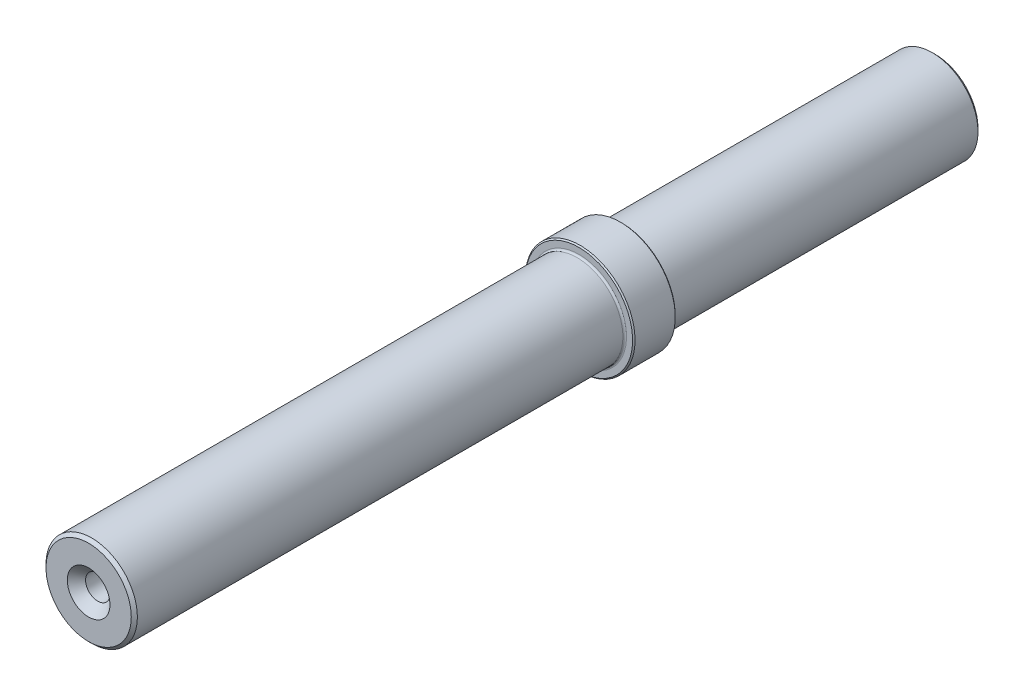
ISO-10303-21;
HEADER;
FILE_DESCRIPTION(('STEP AP214'),'2;1');
FILE_NAME('part.step','',(''),(''),'','','');
FILE_SCHEMA(('AUTOMOTIVE_DESIGN { 1 0 10303 214 1 1 1 1 }'));
ENDSEC;
DATA;
#1=APPLICATION_CONTEXT('core data for automotive mechanical design processes');
#2=APPLICATION_PROTOCOL_DEFINITION('international standard','automotive_design',2000,#1);
#3=PRODUCT_CONTEXT('',#1,'mechanical');
#4=PRODUCT('Part','Part','',(#3));
#5=PRODUCT_RELATED_PRODUCT_CATEGORY('part','',(#4));
#6=PRODUCT_DEFINITION_FORMATION('','',#4);
#7=PRODUCT_DEFINITION_CONTEXT('part definition',#1,'design');
#8=PRODUCT_DEFINITION('design','',#6,#7);
#9=PRODUCT_DEFINITION_SHAPE('','',#8);
#10=(LENGTH_UNIT() NAMED_UNIT(*) SI_UNIT(.MILLI.,.METRE.));
#11=(NAMED_UNIT(*) PLANE_ANGLE_UNIT() SI_UNIT($,.RADIAN.));
#12=(NAMED_UNIT(*) SI_UNIT($,.STERADIAN.) SOLID_ANGLE_UNIT());
#13=UNCERTAINTY_MEASURE_WITH_UNIT(LENGTH_MEASURE(1.E-05),#10,'distance_accuracy_value','');
#14=(GEOMETRIC_REPRESENTATION_CONTEXT(3) GLOBAL_UNCERTAINTY_ASSIGNED_CONTEXT((#13)) GLOBAL_UNIT_ASSIGNED_CONTEXT((#10,
#11,#12)) REPRESENTATION_CONTEXT('',''));
#15=CARTESIAN_POINT('',(0.,0.,0.));
#16=DIRECTION('',(0.,0.,1.));
#17=DIRECTION('',(1.,0.,0.));
#18=AXIS2_PLACEMENT_3D('',#15,#16,#17);
#19=CARTESIAN_POINT('',(0.,0.,139.));
#20=DIRECTION('',(0.,0.,-1.));
#21=DIRECTION('',(-1.,0.,0.));
#22=AXIS2_PLACEMENT_3D('',#19,#20,#21);
#23=CYLINDRICAL_SURFACE('',#22,7.5);
#24=CARTESIAN_POINT('',(0.,0.,138.5));
#25=DIRECTION('',(0.,0.,1.));
#26=DIRECTION('',(1.,0.,0.));
#27=AXIS2_PLACEMENT_3D('',#24,#25,#26);
#28=CIRCLE('',#27,7.5);
#29=CARTESIAN_POINT('',(7.5,0.,138.5));
#30=VERTEX_POINT('',#29);
#31=EDGE_CURVE('E11',#30,#30,#28,.F.);
#32=ORIENTED_EDGE('',*,*,#31,.T.);
#33=EDGE_LOOP('',(#32));
#34=FACE_BOUND('',#33,.T.);
#35=CARTESIAN_POINT('',(0.,0.,58.8));
#36=DIRECTION('',(0.,0.,-1.));
#37=DIRECTION('',(-1.,0.,0.));
#38=AXIS2_PLACEMENT_3D('',#35,#36,#37);
#39=CIRCLE('',#38,7.5);
#40=CARTESIAN_POINT('',(-7.5,0.,58.8));
#41=VERTEX_POINT('',#40);
#42=EDGE_CURVE('E98',#41,#41,#39,.F.);
#43=ORIENTED_EDGE('',*,*,#42,.T.);
#44=EDGE_LOOP('',(#43));
#45=FACE_BOUND('',#44,.T.);
#46=ADVANCED_FACE('F43',(#34,#45),#23,.T.);
#47=CARTESIAN_POINT('',(0.,0.,139.));
#48=DIRECTION('',(0.,0.,1.));
#49=DIRECTION('',(1.,0.,0.));
#50=AXIS2_PLACEMENT_3D('',#47,#48,#49);
#51=PLANE('',#50);
#52=CARTESIAN_POINT('',(0.,0.,139.));
#53=DIRECTION('',(0.,0.,1.));
#54=DIRECTION('',(1.,0.,0.));
#55=AXIS2_PLACEMENT_3D('',#52,#53,#54);
#56=CIRCLE('',#55,6.99999999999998);
#57=CARTESIAN_POINT('',(6.99999999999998,0.,139.));
#58=VERTEX_POINT('',#57);
#59=EDGE_CURVE('E51',#58,#58,#56,.T.);
#60=ORIENTED_EDGE('',*,*,#59,.T.);
#61=EDGE_LOOP('',(#60));
#62=FACE_BOUND('',#61,.T.);
#63=CARTESIAN_POINT('',(0.,0.,139.));
#64=DIRECTION('',(0.,0.,1.));
#65=DIRECTION('',(1.,0.,0.));
#66=AXIS2_PLACEMENT_3D('',#63,#64,#65);
#67=CIRCLE('',#66,3.5);
#68=CARTESIAN_POINT('',(3.5,0.,139.));
#69=VERTEX_POINT('',#68);
#70=EDGE_CURVE('E74',#69,#69,#67,.T.);
#71=ORIENTED_EDGE('',*,*,#70,.F.);
#72=EDGE_LOOP('',(#71));
#73=FACE_BOUND('',#72,.T.);
#74=ADVANCED_FACE('F115',(#62,#73),#51,.T.);
#75=CARTESIAN_POINT('',(0.,0.,58.5));
#76=DIRECTION('',(0.,0.,-1.));
#77=DIRECTION('',(-1.,0.,0.));
#78=AXIS2_PLACEMENT_3D('',#75,#76,#77);
#79=CYLINDRICAL_SURFACE('',#78,9.);
#80=CARTESIAN_POINT('',(0.,0.,58.3));
#81=DIRECTION('',(0.,0.,-1.));
#82=DIRECTION('',(-1.,0.,0.));
#83=AXIS2_PLACEMENT_3D('',#80,#81,#82);
#84=CIRCLE('',#83,9.);
#85=CARTESIAN_POINT('',(-9.,0.,58.3));
#86=VERTEX_POINT('',#85);
#87=EDGE_CURVE('E86',#86,#86,#84,.T.);
#88=ORIENTED_EDGE('',*,*,#87,.T.);
#89=EDGE_LOOP('',(#88));
#90=FACE_BOUND('',#89,.T.);
#91=CARTESIAN_POINT('',(0.,0.,51.7));
#92=DIRECTION('',(0.,0.,-1.));
#93=DIRECTION('',(-1.,0.,0.));
#94=AXIS2_PLACEMENT_3D('',#91,#92,#93);
#95=CIRCLE('',#94,9.);
#96=CARTESIAN_POINT('',(-9.,0.,51.7));
#97=VERTEX_POINT('',#96);
#98=EDGE_CURVE('E83',#97,#97,#95,.F.);
#99=ORIENTED_EDGE('',*,*,#98,.T.);
#100=EDGE_LOOP('',(#99));
#101=FACE_BOUND('',#100,.T.);
#102=ADVANCED_FACE('F134',(#90,#101),#79,.T.);
#103=CARTESIAN_POINT('',(0.,0.,58.5));
#104=DIRECTION('',(0.,0.,-1.));
#105=DIRECTION('',(-1.,0.,0.));
#106=AXIS2_PLACEMENT_3D('',#103,#104,#105);
#107=PLANE('',#106);
#108=CARTESIAN_POINT('',(0.,0.,58.5));
#109=DIRECTION('',(0.,0.,-1.));
#110=DIRECTION('',(-1.,0.,0.));
#111=AXIS2_PLACEMENT_3D('',#108,#109,#110);
#112=CIRCLE('',#111,7.8);
#113=CARTESIAN_POINT('',(-7.8,0.,58.5));
#114=VERTEX_POINT('',#113);
#115=EDGE_CURVE('E95',#114,#114,#112,.T.);
#116=ORIENTED_EDGE('',*,*,#115,.T.);
#117=EDGE_LOOP('',(#116));
#118=FACE_BOUND('',#117,.T.);
#119=CARTESIAN_POINT('',(0.,0.,58.5));
#120=DIRECTION('',(0.,0.,-1.));
#121=DIRECTION('',(-1.,0.,0.));
#122=AXIS2_PLACEMENT_3D('',#119,#120,#121);
#123=CIRCLE('',#122,8.80000000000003);
#124=CARTESIAN_POINT('',(-8.80000000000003,0.,58.5));
#125=VERTEX_POINT('',#124);
#126=EDGE_CURVE('E89',#125,#125,#123,.F.);
#127=ORIENTED_EDGE('',*,*,#126,.T.);
#128=EDGE_LOOP('',(#127));
#129=FACE_BOUND('',#128,.T.);
#130=ADVANCED_FACE('F184',(#118,#129),#107,.F.);
#131=CARTESIAN_POINT('',(0.,0.,51.5));
#132=DIRECTION('',(0.,0.,-1.));
#133=DIRECTION('',(-1.,0.,0.));
#134=AXIS2_PLACEMENT_3D('',#131,#132,#133);
#135=PLANE('',#134);
#136=CARTESIAN_POINT('',(0.,0.,51.5));
#137=DIRECTION('',(0.,0.,-1.));
#138=DIRECTION('',(-1.,0.,0.));
#139=AXIS2_PLACEMENT_3D('',#136,#137,#138);
#140=CIRCLE('',#139,7.8);
#141=CARTESIAN_POINT('',(-7.8,0.,51.5));
#142=VERTEX_POINT('',#141);
#143=EDGE_CURVE('E104',#142,#142,#140,.F.);
#144=ORIENTED_EDGE('',*,*,#143,.T.);
#145=EDGE_LOOP('',(#144));
#146=FACE_BOUND('',#145,.T.);
#147=CARTESIAN_POINT('',(0.,0.,51.5));
#148=DIRECTION('',(0.,0.,-1.));
#149=DIRECTION('',(-1.,0.,0.));
#150=AXIS2_PLACEMENT_3D('',#147,#148,#149);
#151=CIRCLE('',#150,8.8);
#152=CARTESIAN_POINT('',(-8.8,0.,51.5));
#153=VERTEX_POINT('',#152);
#154=EDGE_CURVE('E92',#153,#153,#151,.T.);
#155=ORIENTED_EDGE('',*,*,#154,.T.);
#156=EDGE_LOOP('',(#155));
#157=FACE_BOUND('',#156,.T.);
#158=ADVANCED_FACE('F149',(#146,#157),#135,.T.);
#159=CARTESIAN_POINT('',(0.,0.,0.));
#160=DIRECTION('',(0.,0.,1.));
#161=DIRECTION('',(1.,0.,0.));
#162=AXIS2_PLACEMENT_3D('',#159,#160,#161);
#163=PLANE('',#162);
#164=CARTESIAN_POINT('',(0.,0.,0.));
#165=DIRECTION('',(0.,0.,1.));
#166=DIRECTION('',(1.,0.,0.));
#167=AXIS2_PLACEMENT_3D('',#164,#165,#166);
#168=CIRCLE('',#167,6.99999999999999);
#169=CARTESIAN_POINT('',(6.99999999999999,0.,0.));
#170=VERTEX_POINT('',#169);
#171=EDGE_CURVE('E110',#170,#170,#168,.F.);
#172=ORIENTED_EDGE('',*,*,#171,.T.);
#173=EDGE_LOOP('',(#172));
#174=FACE_BOUND('',#173,.T.);
#175=CARTESIAN_POINT('',(0.,0.,0.));
#176=DIRECTION('',(0.,0.,-1.));
#177=DIRECTION('',(-1.,0.,0.));
#178=AXIS2_PLACEMENT_3D('',#175,#176,#177);
#179=CIRCLE('',#178,2.525);
#180=CARTESIAN_POINT('',(-2.525,0.,0.));
#181=VERTEX_POINT('',#180);
#182=EDGE_CURVE('E67',#181,#181,#179,.T.);
#183=ORIENTED_EDGE('',*,*,#182,.F.);
#184=EDGE_LOOP('',(#183));
#185=FACE_BOUND('',#184,.T.);
#186=ADVANCED_FACE('F141',(#174,#185),#163,.F.);
#187=CARTESIAN_POINT('',(0.,0.,0.5));
#188=DIRECTION('',(0.,0.,1.));
#189=DIRECTION('',(1.,0.,0.));
#190=AXIS2_PLACEMENT_3D('',#187,#188,#189);
#191=CIRCLE('',#190,7.5);
#192=CARTESIAN_POINT('',(7.5,0.,0.5));
#193=VERTEX_POINT('',#192);
#194=EDGE_CURVE('E107',#193,#193,#191,.T.);
#195=ORIENTED_EDGE('',*,*,#194,.T.);
#196=EDGE_LOOP('',(#195));
#197=FACE_BOUND('',#196,.T.);
#198=CARTESIAN_POINT('',(0.,0.,51.2));
#199=DIRECTION('',(0.,0.,-1.));
#200=DIRECTION('',(-1.,0.,0.));
#201=AXIS2_PLACEMENT_3D('',#198,#199,#200);
#202=CIRCLE('',#201,7.5);
#203=CARTESIAN_POINT('',(-7.5,0.,51.2));
#204=VERTEX_POINT('',#203);
#205=EDGE_CURVE('E101',#204,#204,#202,.T.);
#206=ORIENTED_EDGE('',*,*,#205,.T.);
#207=EDGE_LOOP('',(#206));
#208=FACE_BOUND('',#207,.T.);
#209=ADVANCED_FACE('F130',(#197,#208),#23,.T.);
#210=CARTESIAN_POINT('',(0.,0.,12.4));
#211=DIRECTION('',(0.,0.,-1.));
#212=DIRECTION('',(-1.,0.,0.));
#213=AXIS2_PLACEMENT_3D('',#210,#211,#212);
#214=CONICAL_SURFACE('',#213,2.1,1.02974425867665);
#215=CARTESIAN_POINT('',(0.,0.,13.6618072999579));
#216=VERTEX_POINT('',#215);
#217=VERTEX_LOOP('',#216);
#218=FACE_BOUND('',#217,.T.);
#219=CARTESIAN_POINT('',(0.,0.,12.4));
#220=DIRECTION('',(0.,0.,-1.));
#221=DIRECTION('',(-1.,0.,0.));
#222=AXIS2_PLACEMENT_3D('',#219,#220,#221);
#223=CIRCLE('',#222,2.1);
#224=CARTESIAN_POINT('',(-2.1,0.,12.4));
#225=VERTEX_POINT('',#224);
#226=EDGE_CURVE('E80',#225,#225,#223,.T.);
#227=ORIENTED_EDGE('',*,*,#226,.T.);
#228=EDGE_LOOP('',(#227));
#229=FACE_BOUND('',#228,.T.);
#230=ADVANCED_FACE('F140',(#218,#229),#214,.F.);
#231=CARTESIAN_POINT('',(0.,0.,0.));
#232=DIRECTION('',(0.,0.,-1.));
#233=DIRECTION('',(-1.,0.,0.));
#234=AXIS2_PLACEMENT_3D('',#231,#232,#233);
#235=CYLINDRICAL_SURFACE('',#234,2.1);
#236=ORIENTED_EDGE('',*,*,#226,.F.);
#237=EDGE_LOOP('',(#236));
#238=FACE_BOUND('',#237,.T.);
#239=CARTESIAN_POINT('',(0.,0.,0.425));
#240=DIRECTION('',(0.,0.,-1.));
#241=DIRECTION('',(-1.,0.,0.));
#242=AXIS2_PLACEMENT_3D('',#239,#240,#241);
#243=CIRCLE('',#242,2.1);
#244=CARTESIAN_POINT('',(-2.1,0.,0.425));
#245=VERTEX_POINT('',#244);
#246=EDGE_CURVE('E71',#245,#245,#243,.T.);
#247=ORIENTED_EDGE('',*,*,#246,.T.);
#248=EDGE_LOOP('',(#247));
#249=FACE_BOUND('',#248,.T.);
#250=ADVANCED_FACE('F147',(#238,#249),#235,.F.);
#251=CARTESIAN_POINT('',(0.,0.,0.));
#252=DIRECTION('',(0.,0.,-1.));
#253=DIRECTION('',(-1.,0.,0.));
#254=AXIS2_PLACEMENT_3D('',#251,#252,#253);
#255=CONICAL_SURFACE('',#254,2.525,0.78539816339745);
#256=ORIENTED_EDGE('',*,*,#246,.F.);
#257=EDGE_LOOP('',(#256));
#258=FACE_BOUND('',#257,.T.);
#259=ORIENTED_EDGE('',*,*,#182,.T.);
#260=EDGE_LOOP('',(#259));
#261=FACE_BOUND('',#260,.T.);
#262=ADVANCED_FACE('F61',(#258,#261),#255,.F.);
#263=CARTESIAN_POINT('',(0.,0.,124.));
#264=DIRECTION('',(0.,0.,1.));
#265=DIRECTION('',(1.,0.,0.));
#266=AXIS2_PLACEMENT_3D('',#263,#264,#265);
#267=CONICAL_SURFACE('',#266,2.,1.02974425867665);
#268=CARTESIAN_POINT('',(0.,0.,122.798278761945));
#269=VERTEX_POINT('',#268);
#270=VERTEX_LOOP('',#269);
#271=FACE_BOUND('',#270,.T.);
#272=CARTESIAN_POINT('',(0.,0.,124.));
#273=DIRECTION('',(0.,0.,1.));
#274=DIRECTION('',(1.,0.,0.));
#275=AXIS2_PLACEMENT_3D('',#272,#273,#274);
#276=CIRCLE('',#275,2.);
#277=CARTESIAN_POINT('',(2.,0.,124.));
#278=VERTEX_POINT('',#277);
#279=EDGE_CURVE('E65',#278,#278,#276,.T.);
#280=ORIENTED_EDGE('',*,*,#279,.T.);
#281=EDGE_LOOP('',(#280));
#282=FACE_BOUND('',#281,.T.);
#283=ADVANCED_FACE('F57',(#271,#282),#267,.F.);
#284=CARTESIAN_POINT('',(0.,0.,139.));
#285=DIRECTION('',(0.,0.,1.));
#286=DIRECTION('',(1.,0.,0.));
#287=AXIS2_PLACEMENT_3D('',#284,#285,#286);
#288=CYLINDRICAL_SURFACE('',#287,2.);
#289=ORIENTED_EDGE('',*,*,#279,.F.);
#290=EDGE_LOOP('',(#289));
#291=FACE_BOUND('',#290,.T.);
#292=CARTESIAN_POINT('',(0.,0.,137.5));
#293=DIRECTION('',(0.,0.,1.));
#294=DIRECTION('',(1.,0.,0.));
#295=AXIS2_PLACEMENT_3D('',#292,#293,#294);
#296=CIRCLE('',#295,2.);
#297=CARTESIAN_POINT('',(2.,0.,137.5));
#298=VERTEX_POINT('',#297);
#299=EDGE_CURVE('E68',#298,#298,#296,.T.);
#300=ORIENTED_EDGE('',*,*,#299,.T.);
#301=EDGE_LOOP('',(#300));
#302=FACE_BOUND('',#301,.T.);
#303=ADVANCED_FACE('F60',(#291,#302),#288,.F.);
#304=CARTESIAN_POINT('',(0.,0.,139.));
#305=DIRECTION('',(0.,0.,1.));
#306=DIRECTION('',(1.,0.,0.));
#307=AXIS2_PLACEMENT_3D('',#304,#305,#306);
#308=CONICAL_SURFACE('',#307,3.5,0.785398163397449);
#309=ORIENTED_EDGE('',*,*,#299,.F.);
#310=EDGE_LOOP('',(#309));
#311=FACE_BOUND('',#310,.T.);
#312=ORIENTED_EDGE('',*,*,#70,.T.);
#313=EDGE_LOOP('',(#312));
#314=FACE_BOUND('',#313,.T.);
#315=ADVANCED_FACE('F171',(#311,#314),#308,.F.);
#316=CARTESIAN_POINT('',(0.,0.,58.3));
#317=DIRECTION('',(0.,0.,-1.));
#318=DIRECTION('',(-1.,0.,0.));
#319=AXIS2_PLACEMENT_3D('',#316,#317,#318);
#320=CONICAL_SURFACE('',#319,9.,0.785398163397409);
#321=ORIENTED_EDGE('',*,*,#126,.F.);
#322=EDGE_LOOP('',(#321));
#323=FACE_BOUND('',#322,.T.);
#324=ORIENTED_EDGE('',*,*,#87,.F.);
#325=EDGE_LOOP('',(#324));
#326=FACE_BOUND('',#325,.T.);
#327=ADVANCED_FACE('F168',(#323,#326),#320,.T.);
#328=CARTESIAN_POINT('',(0.,0.,51.5));
#329=DIRECTION('',(0.,0.,1.));
#330=DIRECTION('',(1.,0.,0.));
#331=AXIS2_PLACEMENT_3D('',#328,#329,#330);
#332=CONICAL_SURFACE('',#331,8.8,0.785398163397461);
#333=ORIENTED_EDGE('',*,*,#98,.F.);
#334=EDGE_LOOP('',(#333));
#335=FACE_BOUND('',#334,.T.);
#336=ORIENTED_EDGE('',*,*,#154,.F.);
#337=EDGE_LOOP('',(#336));
#338=FACE_BOUND('',#337,.T.);
#339=ADVANCED_FACE('F162',(#335,#338),#332,.T.);
#340=CARTESIAN_POINT('',(0.,0.,58.8));
#341=DIRECTION('',(0.,0.,-1.));
#342=DIRECTION('',(-1.,0.,0.));
#343=AXIS2_PLACEMENT_3D('',#340,#341,#342);
#344=TOROIDAL_SURFACE('',#343,7.8,0.3);
#345=ORIENTED_EDGE('',*,*,#42,.F.);
#346=EDGE_LOOP('',(#345));
#347=FACE_BOUND('',#346,.T.);
#348=ORIENTED_EDGE('',*,*,#115,.F.);
#349=EDGE_LOOP('',(#348));
#350=FACE_BOUND('',#349,.T.);
#351=ADVANCED_FACE('F156',(#347,#350),#344,.F.);
#352=CARTESIAN_POINT('',(0.,0.,51.2));
#353=DIRECTION('',(0.,0.,-1.));
#354=DIRECTION('',(-1.,0.,0.));
#355=AXIS2_PLACEMENT_3D('',#352,#353,#354);
#356=TOROIDAL_SURFACE('',#355,7.8,0.3);
#357=ORIENTED_EDGE('',*,*,#143,.F.);
#358=EDGE_LOOP('',(#357));
#359=FACE_BOUND('',#358,.T.);
#360=ORIENTED_EDGE('',*,*,#205,.F.);
#361=EDGE_LOOP('',(#360));
#362=FACE_BOUND('',#361,.T.);
#363=ADVANCED_FACE('F124',(#359,#362),#356,.F.);
#364=CARTESIAN_POINT('',(0.,0.,0.5));
#365=DIRECTION('',(0.,0.,1.));
#366=DIRECTION('',(1.,0.,0.));
#367=AXIS2_PLACEMENT_3D('',#364,#365,#366);
#368=CONICAL_SURFACE('',#367,7.5,0.785398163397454);
#369=ORIENTED_EDGE('',*,*,#171,.F.);
#370=EDGE_LOOP('',(#369));
#371=FACE_BOUND('',#370,.T.);
#372=ORIENTED_EDGE('',*,*,#194,.F.);
#373=EDGE_LOOP('',(#372));
#374=FACE_BOUND('',#373,.T.);
#375=ADVANCED_FACE('F119',(#371,#374),#368,.T.);
#376=CARTESIAN_POINT('',(0.,0.,139.));
#377=DIRECTION('',(0.,0.,-1.));
#378=DIRECTION('',(-1.,0.,0.));
#379=AXIS2_PLACEMENT_3D('',#376,#377,#378);
#380=CONICAL_SURFACE('',#379,6.99999999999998,0.785398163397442);
#381=ORIENTED_EDGE('',*,*,#31,.F.);
#382=EDGE_LOOP('',(#381));
#383=FACE_BOUND('',#382,.T.);
#384=ORIENTED_EDGE('',*,*,#59,.F.);
#385=EDGE_LOOP('',(#384));
#386=FACE_BOUND('',#385,.T.);
#387=ADVANCED_FACE('F45',(#383,#386),#380,.T.);
#388=CLOSED_SHELL('',(#46,#74,#102,#130,#158,#186,#209,#230,#250,#262,#283,#303,#315,#327,#339,
#351,#363,#375,#387));
#389=MANIFOLD_SOLID_BREP('B2',#388);
#390=ADVANCED_BREP_SHAPE_REPRESENTATION('',(#18,#389),#14);
#391=SHAPE_DEFINITION_REPRESENTATION(#9,#390);
ENDSEC;
END-ISO-10303-21;
